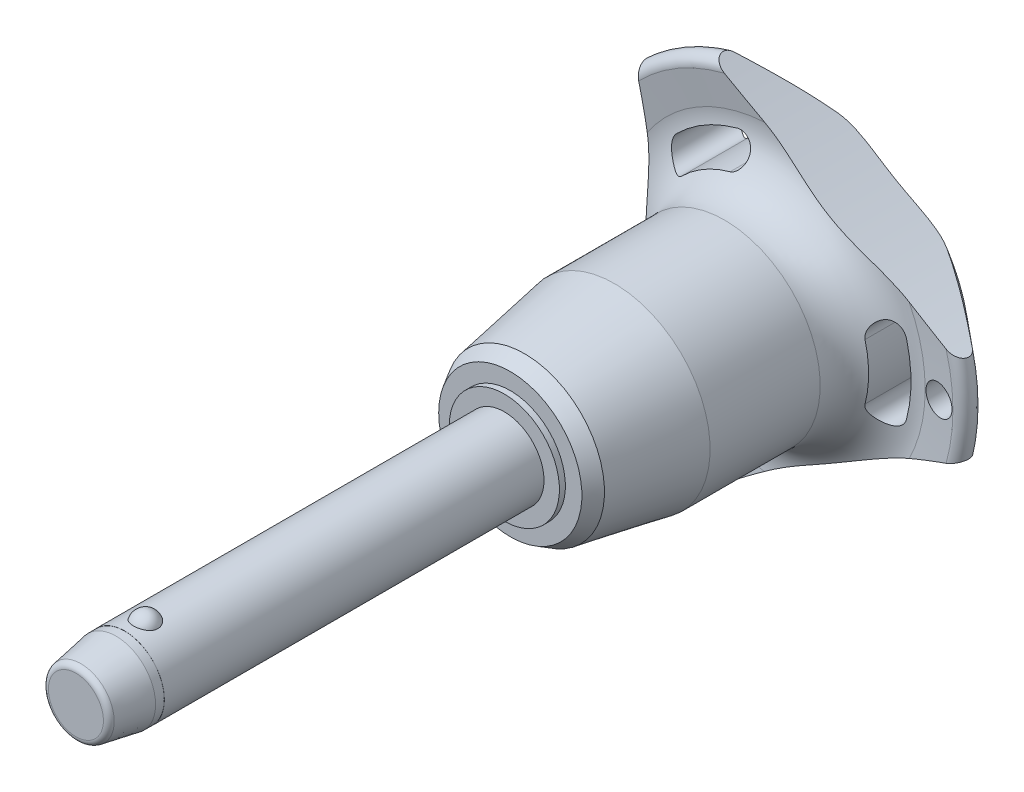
from build123d import *

# Parameters (mm, degrees)
SKETCH1_R           = 4
BOSS_EXTRUDE1_DEPTH = 35
SKETCH2_R           = 3.4
BOSS_EXTRUDE2_DEPTH = 33.3
BOSS_EXTRUDE3_START = 8.2
SKETCH1_2_R         = 4
BOSS_EXTRUDE3_DEPTH = 8.2
CHAMFER1_SIZE       = 4.1
CHAMFER1_SIZE2      = 0.722940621
FILLET1_R           = 0.6
SKETCH6_R           = 102.8
CUT_EXTRUDE1_DEPTH  = 74.713650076
CIRPATTERN1_COUNT   = 3
SKETCH7_R           = 1.5
CUT_EXTRUDE2_DEPTH  = 74.493908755
SKETCH8_R           = 4
SKETCH8_R_2         = 3.99
CUT_EXTRUDE3_DEPTH  = 4.92


with BuildPart() as part:
    # Sketch1 → Boss-Extrude1 (new body)
    with BuildSketch(Plane.XY):
        Circle(SKETCH1_R)
    extrude(amount=-BOSS_EXTRUDE1_DEPTH)

    # Sketch2 → Boss-Extrude2 (add)
    with BuildSketch(Plane(origin=(0, 0, -35), x_dir=(-1, 0, 0), z_dir=(0, 0, -1))):
        Circle(SKETCH2_R)
    extrude(amount=BOSS_EXTRUDE2_DEPTH)

    # Sketch3 → Revolve1 (revolve)
    with BuildSketch(Plane(origin=(0, 0, 0), x_dir=(0, 0, -1), z_dir=(1, 0, 0))):
        with BuildLine():
            Line((-1.2, 4.8), (-1.2, 2.2))
            ThreePointArc((-1.2, 2.2), (0.1, 3.5), (-1.2, 4.8))
        make_face()
        with BuildLine():
            Line((-1.2, -2.2), (-1.2, -4.8))
            ThreePointArc((-1.2, -4.8), (0.1, -3.5), (-1.2, -2.2))
        make_face()
    revolve(axis=Axis((0, -2.2, 1.2), (0, 1, 0)))

    # Sketch1_2 → Boss-Extrude3 (add)
    with BuildSketch(Plane.XY.offset(BOSS_EXTRUDE3_START)):
        Circle(SKETCH1_2_R)
    extrude(amount=-BOSS_EXTRUDE3_DEPTH)

    # Chamfer1
    chamfer1_edges = [part.edges().sort_by_distance(p)[0] for p in [
        (-4, 0, 8.2),
    ]]
    chamfer1_side = [part.faces().sort_by_distance(p)[0] for p in [
        (-4, 0, -13.4),
    ]]
    chamfer(chamfer1_edges, length=CHAMFER1_SIZE, length2=CHAMFER1_SIZE2, reference=chamfer1_side[0])

    # Fillet1
    fillet1_edges = [part.edges().sort_by_distance(p)[0] for p in [
        (-3.277059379, 0, 8.2),
        (3.4, 0, -68.3),
    ]]
    fillet(fillet1_edges, radius=FILLET1_R)

    # Sketch4 → Revolve2 (revolve)
    with BuildSketch(Plane(origin=(0, 0, 0), x_dir=(0, 0, -1), z_dir=(1, 0, 0)), mode=Mode.PRIVATE) as revolve2_sk:
        Polygon((35, 0), (35, 5.554101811), (35.6, 5.554101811), (35.6, 7.220004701), (37.042714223, 8.052956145), (46.1, 9.65), (57.2, 9.65), (57.2, 0), align=None)
    revolve(revolve2_sk.sketch.rotate(Axis((0, 0, -57.2), (0, 0, 1)), 90), axis=Axis((0, 0, -57.2), (0, 0, 1)))

    # Sketch5 → Revolve3 (revolve)
    with BuildSketch(Plane(origin=(0, 0, 0), x_dir=(0, 0, -1), z_dir=(1, 0, 0)), mode=Mode.PRIVATE) as revolve3_sk:
        with BuildLine():
            Line((62.16082631, 15.274661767), (61.757834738, 18.475067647))
            ThreePointArc((61.757834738, 18.475067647), (62.349836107, 19.516443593), (63.516044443, 19.24278761))
            Line((63.516044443, 19.24278761), (67.835691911, 14.094832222))
            ThreePointArc((67.835691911, 14.094832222), (68.3, 12.689260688), (67.67067517, 11.349423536))
            ThreePointArc((67.67067517, 11.349423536), (64.033110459, 6.185112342), (62.75, 0))
            Line((62.75, 0), (57.2, 0))
            Line((57.2, 0), (57.2, 9.65))
            ThreePointArc((57.2, 9.65), (60.949887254, 11.342683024), (62.16082631, 15.274661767))
        make_face()
    revolve(revolve3_sk.sketch.rotate(Axis((0, 0, -62.75), (0, 0, 1)), 90), axis=Axis((0, 0, -62.75), (0, 0, 1)))

    # Sketch6 → Cut-Extrude1 (cut, through all)
    with BuildSketch(Plane.XY):
        with Locations((-115.2, 0)):
            Circle(SKETCH6_R)
        with BuildLine():
            ThreePointArc((13.411913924, -3.529271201), (13.868496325, 0), (13.411913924, 3.529271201))
            ThreePointArc((13.411913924, 3.529271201), (11.694200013, 4.531299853), (10.692171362, 2.813585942))
            ThreePointArc((10.692171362, 2.813585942), (11.056165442, 0), (10.692171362, -2.813585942))
            ThreePointArc((10.692171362, -2.813585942), (11.694200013, -4.531299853), (13.411913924, -3.529271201))
        make_face()
    cut_extrude1 = extrude(amount=-CUT_EXTRUDE1_DEPTH, mode=Mode.SUBTRACT)

    # CirPattern1: Cut-Extrude1 ×3 about axis
    cirpattern1_axis = Axis((0, 0, 0), (0, 0, 1))
    for i in range(1, CIRPATTERN1_COUNT):
        add(cut_extrude1.rotate(cirpattern1_axis, i * 360 / CIRPATTERN1_COUNT), mode=Mode.SUBTRACT)

    # Sketch7 → Cut-Extrude2 (cut, through all)
    with BuildSketch(Plane.XY):
        with Locations(Location((16.868496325, 0, 0), (0, 0, 225.467095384))):
            Circle(SKETCH7_R)
    extrude(amount=-CUT_EXTRUDE2_DEPTH, mode=Mode.SUBTRACT)

    # Sketch8 → Cut-Extrude3 (cut)
    with BuildSketch(Plane.XY.offset(8.2)):
        Circle(SKETCH8_R)
        Circle(SKETCH8_R_2, mode=Mode.SUBTRACT)
    extrude(amount=-CUT_EXTRUDE3_DEPTH, mode=Mode.SUBTRACT)


solid = part.part
